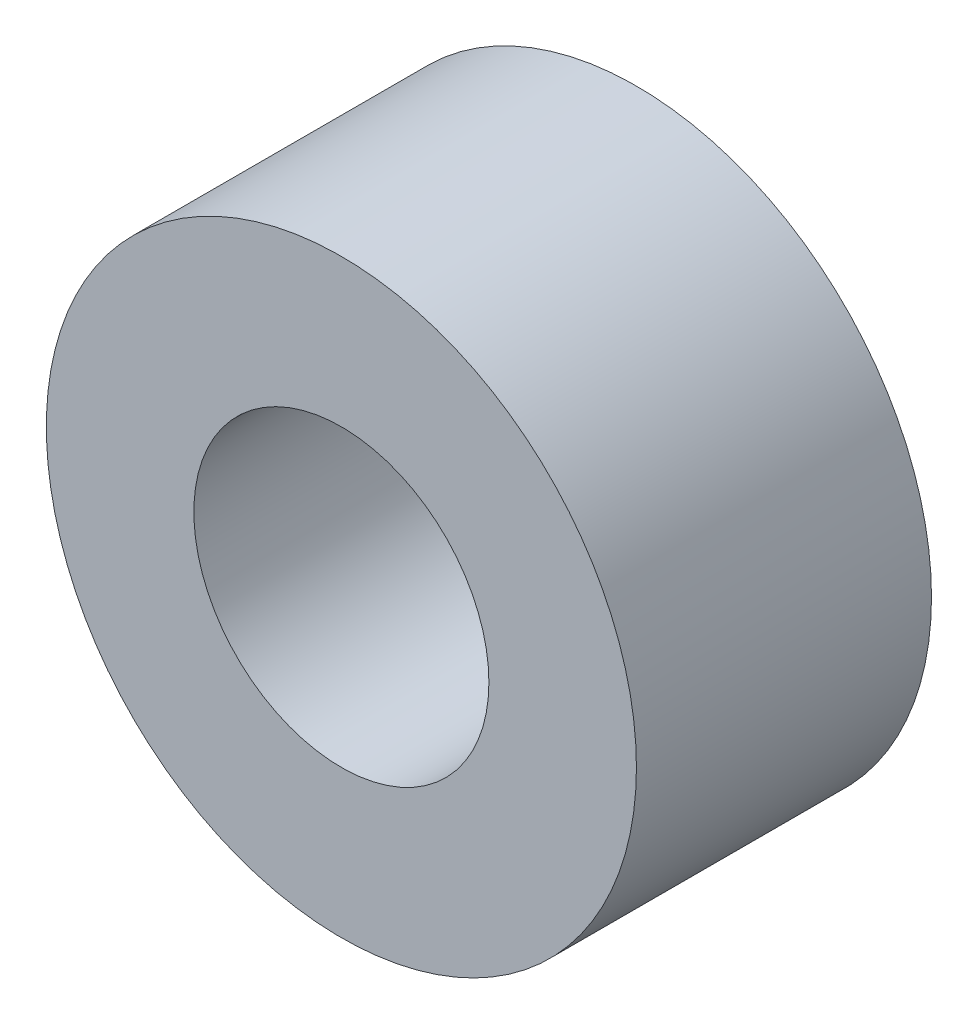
from build123d import *

# Parameters (mm, degrees)
ESQUISSE1_R      = 0.8
ESQUISSE1_R_2    = 0.4
EXTRUSION1_DEPTH = 0.8


with BuildPart() as part:
    # Esquisse1 → Extrusion1 (new body)
    with BuildSketch(Plane.XY):
        Circle(ESQUISSE1_R)
        Circle(ESQUISSE1_R_2, mode=Mode.SUBTRACT)
    extrude(amount=EXTRUSION1_DEPTH)


solid = part.part
